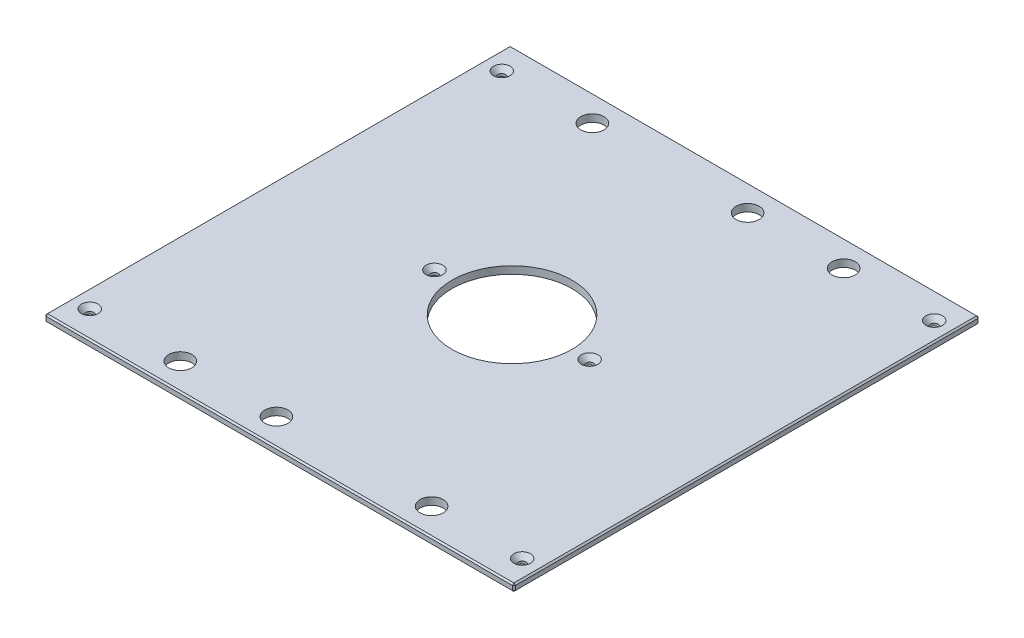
from build123d import *

# Parameters (mm, degrees)
SKETCH1_W                                     = 403.225
SKETCH1_H                                     = 400.05
BOSS_EXTRUDE1_DEPTH                           = 6.35
SKETCH13_R                                    = 51.562
CUT_EXTRUDE6_DEPTH                            = 285.073799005
F_25_32_0_78125_DIAMETER_HOLE1_D              = 19.84375
CHAMFER2_SIZE                                 = 1.27
CSK_FOR_1_4_FLAT_HEAD_MACHINE_SCREW1_AT_COUNT = 2
CSK_FOR_1_4_FLAT_HEAD_MACHINE_SCREW1_AT_PITCH = 354.00996
CSK_FOR_1_4_FLAT_HEAD_MACHINE_SCREW1_2_COUNT  = 2
CSK_FOR_1_4_FLAT_HEAD_MACHINE_SCREW1_2_PITCH  = 513.143963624
CSK_FOR_1_4_FLAT_HEAD_MACHINE_SCREW1_3_COUNT  = 2
CSK_FOR_1_4_FLAT_HEAD_MACHINE_SCREW1_3_PITCH  = 308.290176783
CSK_FOR_1_4_FLAT_HEAD_MACHINE_SCREW1_4_COUNT  = 2
CSK_FOR_1_4_FLAT_HEAD_MACHINE_SCREW1_4_PITCH  = 213.322858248
CSK_FOR_1_4_FLAT_HEAD_MACHINE_SCREW1_5_COUNT  = 2
CSK_FOR_1_4_FLAT_HEAD_MACHINE_SCREW1_5_PITCH  = 371.475
CSK_FOR_1_4_FLAT_HEAD_MACHINE_SCREW1_6_COUNT  = 2
CSK_FOR_1_4_FLAT_HEAD_MACHINE_SCREW1_6_PITCH  = 293.6875
CSK_FOR_1_4_FLAT_HEAD_MACHINE_SCREW1_7_COUNT  = 2
CSK_FOR_1_4_FLAT_HEAD_MACHINE_SCREW1_7_PITCH  = 459.973259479


with BuildPart() as part:
    # Sketch1 → Boss-Extrude1 (new body)
    with BuildSketch(Plane(origin=(0, 0, 0), x_dir=(1, 0, 0), z_dir=(0, 1, 0))):
        Rectangle(SKETCH1_W, SKETCH1_H)
    extrude(amount=BOSS_EXTRUDE1_DEPTH)

    # Sketch13 → Cut-Extrude6 (cut, through all)
    with BuildSketch(Plane(origin=(0, 6.35, 0), x_dir=(1, 0, 0), z_dir=(0, 1, 0))):
        with Locations(Location((0, 0, 0), (0, 0, 270))):
            Circle(SKETCH13_R)
    extrude(amount=-CUT_EXTRUDE6_DEPTH, mode=Mode.SUBTRACT)

    # 25_32 _0.78125_ Diameter Hole1 (through all)
    with Locations(Plane(origin=(0, 6.35, 0), x_dir=(1, 0, 0), z_dir=(0, 1, 0))):
        with Locations((107.95, 177.00498), (-107.95, 177.00498), (107.95, -177.00498), (-107.95, -177.00498), (25.4, 177.00498), (-25.4, -177.00498)):
            Hole(F_25_32_0_78125_DIAMETER_HOLE1_D / 2)

    # Chamfer2
    chamfer2_edges = [part.edges().sort_by_distance(p)[0] for p in [
        (201.6125, 6.35, 0),
        (0, 6.35, -200.025),
        (-201.6125, 6.35, 0),
        (0, 0, -200.025),
        (201.6125, 0, 0),
        (0, 0, 200.025),
        (-201.6125, 0, 0),
        (0, 6.35, 200.025),
        (-201.6125, 3.175, -200.025),
        (201.6125, 3.175, -200.025),
        (201.6125, 3.175, 200.025),
        (-201.6125, 3.175, 200.025),
    ]]
    chamfer(chamfer2_edges, length=CHAMFER2_SIZE)

    # Sketch24 → CSK for 1_4 Flat Head Machine Screw1 (revolve, cut)
    with BuildSketch(Plane(origin=(185.7375, 6.35, -177.00498), x_dir=(0, 0, 1), z_dir=(1, 0, 0))):
        Polygon((0, 0), (0, 6.35), (3.3782, 6.35), (3.3782, 4.324464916), (7.1374, 0), align=None)
    csk_for_1_4_flat_head_machine_screw1 = revolve(axis=Axis((185.7375, 12.7, -177.00498), (0, -1, 0)), mode=Mode.SUBTRACT)

    # CSK for 1_4 Flat Head Machine Screw1 at: CSK for 1_4 Flat Head Machine Screw1 ×2
    with Locations(*[(0, 0, i * CSK_FOR_1_4_FLAT_HEAD_MACHINE_SCREW1_AT_PITCH) for i in range(1, CSK_FOR_1_4_FLAT_HEAD_MACHINE_SCREW1_AT_COUNT)]):
        add(csk_for_1_4_flat_head_machine_screw1, mode=Mode.SUBTRACT)

    # CSK for 1_4 Flat Head Machine Screw1 2: CSK for 1_4 Flat Head Machine Screw1 ×2
    with Locations(*[Vector(-0.7239196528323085, 0, 0.6898842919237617) * (i * CSK_FOR_1_4_FLAT_HEAD_MACHINE_SCREW1_2_PITCH) for i in range(1, CSK_FOR_1_4_FLAT_HEAD_MACHINE_SCREW1_2_COUNT)]):
        add(csk_for_1_4_flat_head_machine_screw1, mode=Mode.SUBTRACT)

    # CSK for 1_4 Flat Head Machine Screw1 3: CSK for 1_4 Flat Head Machine Screw1 ×2
    with Locations(*[Vector(-0.8187497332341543, 0, 0.5741505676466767) * (i * CSK_FOR_1_4_FLAT_HEAD_MACHINE_SCREW1_3_PITCH) for i in range(1, CSK_FOR_1_4_FLAT_HEAD_MACHINE_SCREW1_3_COUNT)]):
        add(csk_for_1_4_flat_head_machine_screw1, mode=Mode.SUBTRACT)

    # CSK for 1_4 Flat Head Machine Screw1 4: CSK for 1_4 Flat Head Machine Screw1 ×2
    with Locations(*[Vector(-0.5581328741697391, 0, 0.8297515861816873) * (i * CSK_FOR_1_4_FLAT_HEAD_MACHINE_SCREW1_4_PITCH) for i in range(1, CSK_FOR_1_4_FLAT_HEAD_MACHINE_SCREW1_4_COUNT)]):
        add(csk_for_1_4_flat_head_machine_screw1, mode=Mode.SUBTRACT)

    # CSK for 1_4 Flat Head Machine Screw1 5: CSK for 1_4 Flat Head Machine Screw1 ×2
    with Locations(*[(-i * CSK_FOR_1_4_FLAT_HEAD_MACHINE_SCREW1_5_PITCH, 0, 0) for i in range(1, CSK_FOR_1_4_FLAT_HEAD_MACHINE_SCREW1_5_COUNT)]):
        add(csk_for_1_4_flat_head_machine_screw1, mode=Mode.SUBTRACT)

    # CSK for 1_4 Flat Head Machine Screw1 6: CSK for 1_4 Flat Head Machine Screw1 ×2
    with Locations(*[(-i * CSK_FOR_1_4_FLAT_HEAD_MACHINE_SCREW1_6_PITCH, 0, 0) for i in range(1, CSK_FOR_1_4_FLAT_HEAD_MACHINE_SCREW1_6_COUNT)]):
        add(csk_for_1_4_flat_head_machine_screw1, mode=Mode.SUBTRACT)

    # CSK for 1_4 Flat Head Machine Screw1 7: CSK for 1_4 Flat Head Machine Screw1 ×2
    with Locations(*[Vector(-0.6384882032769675, 0, 0.7696316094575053) * (i * CSK_FOR_1_4_FLAT_HEAD_MACHINE_SCREW1_7_PITCH) for i in range(1, CSK_FOR_1_4_FLAT_HEAD_MACHINE_SCREW1_7_COUNT)]):
        add(csk_for_1_4_flat_head_machine_screw1, mode=Mode.SUBTRACT)


solid = part.part
